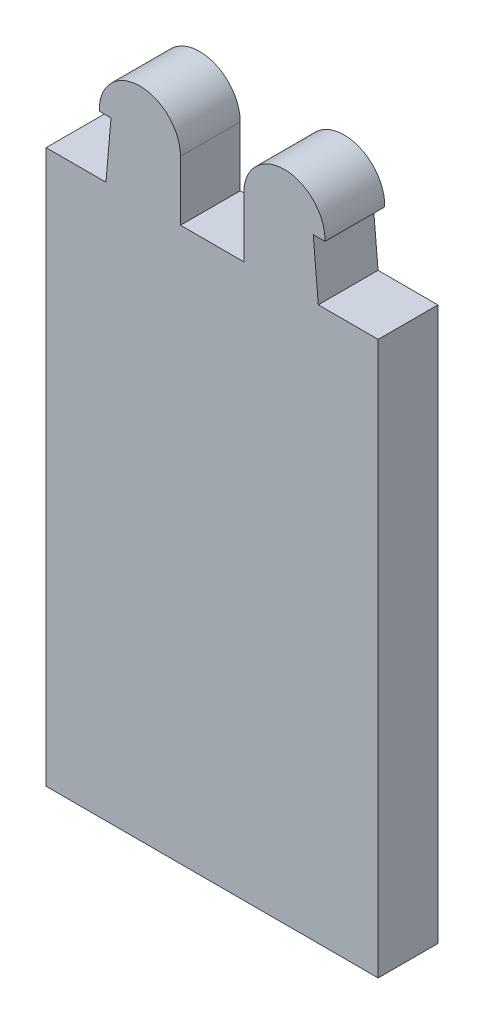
ISO-10303-21;
HEADER;
FILE_DESCRIPTION(('STEP AP214'),'2;1');
FILE_NAME('part.step','',(''),(''),'','','');
FILE_SCHEMA(('AUTOMOTIVE_DESIGN { 1 0 10303 214 1 1 1 1 }'));
ENDSEC;
DATA;
#1=APPLICATION_CONTEXT('core data for automotive mechanical design processes');
#2=APPLICATION_PROTOCOL_DEFINITION('international standard','automotive_design',2000,#1);
#3=PRODUCT_CONTEXT('',#1,'mechanical');
#4=PRODUCT('Part','Part','',(#3));
#5=PRODUCT_RELATED_PRODUCT_CATEGORY('part','',(#4));
#6=PRODUCT_DEFINITION_FORMATION('','',#4);
#7=PRODUCT_DEFINITION_CONTEXT('part definition',#1,'design');
#8=PRODUCT_DEFINITION('design','',#6,#7);
#9=PRODUCT_DEFINITION_SHAPE('','',#8);
#10=(LENGTH_UNIT() NAMED_UNIT(*) SI_UNIT(.MILLI.,.METRE.));
#11=(NAMED_UNIT(*) PLANE_ANGLE_UNIT() SI_UNIT($,.RADIAN.));
#12=(NAMED_UNIT(*) SI_UNIT($,.STERADIAN.) SOLID_ANGLE_UNIT());
#13=UNCERTAINTY_MEASURE_WITH_UNIT(LENGTH_MEASURE(1.E-05),#10,'distance_accuracy_value','');
#14=(GEOMETRIC_REPRESENTATION_CONTEXT(3) GLOBAL_UNCERTAINTY_ASSIGNED_CONTEXT((#13)) GLOBAL_UNIT_ASSIGNED_CONTEXT((#10,
#11,#12)) REPRESENTATION_CONTEXT('',''));
#15=CARTESIAN_POINT('',(0.,0.,0.));
#16=DIRECTION('',(0.,0.,1.));
#17=DIRECTION('',(1.,0.,0.));
#18=AXIS2_PLACEMENT_3D('',#15,#16,#17);
#19=CARTESIAN_POINT('',(-3.26487000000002,15.2,2.7));
#20=DIRECTION('',(0.,0.,-1.));
#21=DIRECTION('',(-1.,0.,0.));
#22=AXIS2_PLACEMENT_3D('',#19,#20,#21);
#23=CYLINDRICAL_SURFACE('',#22,1.83487);
#24=CARTESIAN_POINT('',(-3.26487000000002,15.2,0.));
#25=DIRECTION('',(0.,0.,1.));
#26=DIRECTION('',(1.,0.,0.));
#27=AXIS2_PLACEMENT_3D('',#24,#25,#26);
#28=CIRCLE('',#27,1.83487);
#29=CARTESIAN_POINT('',(-5.09840426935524,15.13,0.));
#30=VERTEX_POINT('',#29);
#31=CARTESIAN_POINT('',(-1.43000000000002,15.2,0.));
#32=VERTEX_POINT('',#31);
#33=EDGE_CURVE('E182',#30,#32,#28,.F.);
#34=ORIENTED_EDGE('',*,*,#33,.F.);
#35=DIRECTION('',(0.,0.,-1.));
#36=VECTOR('',#35,1.);
#37=CARTESIAN_POINT('',(-5.09840426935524,15.13,2.7));
#38=LINE('',#37,#36);
#39=CARTESIAN_POINT('',(-5.09840426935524,15.13,2.7));
#40=VERTEX_POINT('',#39);
#41=EDGE_CURVE('E11',#40,#30,#38,.T.);
#42=ORIENTED_EDGE('',*,*,#41,.F.);
#43=CARTESIAN_POINT('',(-3.26487000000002,15.2,2.7));
#44=DIRECTION('',(0.,0.,1.));
#45=DIRECTION('',(1.,0.,0.));
#46=AXIS2_PLACEMENT_3D('',#43,#44,#45);
#47=CIRCLE('',#46,1.83487);
#48=CARTESIAN_POINT('',(-1.43000000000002,15.2,2.7));
#49=VERTEX_POINT('',#48);
#50=EDGE_CURVE('E229',#40,#49,#47,.F.);
#51=ORIENTED_EDGE('',*,*,#50,.T.);
#52=DIRECTION('',(0.,0.,-1.));
#53=VECTOR('',#52,1.);
#54=CARTESIAN_POINT('',(-1.43000000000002,15.2,2.7));
#55=LINE('',#54,#53);
#56=EDGE_CURVE('E116',#49,#32,#55,.T.);
#57=ORIENTED_EDGE('',*,*,#56,.T.);
#58=EDGE_LOOP('',(#34,#42,#51,#57));
#59=FACE_BOUND('',#58,.T.);
#60=ADVANCED_FACE('F47',(#59),#23,.T.);
#61=CARTESIAN_POINT('',(0.,15.13,2.7));
#62=DIRECTION('',(0.,-1.,0.));
#63=DIRECTION('',(0.,0.,-1.));
#64=AXIS2_PLACEMENT_3D('',#61,#62,#63);
#65=PLANE('',#64);
#66=DIRECTION('',(-1.,0.,0.));
#67=VECTOR('',#66,1.);
#68=CARTESIAN_POINT('',(0.,15.13,0.));
#69=LINE('',#68,#67);
#70=CARTESIAN_POINT('',(-4.57000000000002,15.13,0.));
#71=VERTEX_POINT('',#70);
#72=EDGE_CURVE('E186',#71,#30,#69,.T.);
#73=ORIENTED_EDGE('',*,*,#72,.F.);
#74=DIRECTION('',(0.,0.,-1.));
#75=VECTOR('',#74,1.);
#76=CARTESIAN_POINT('',(-4.57000000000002,15.13,2.7));
#77=LINE('',#76,#75);
#78=CARTESIAN_POINT('',(-4.57000000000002,15.13,2.7));
#79=VERTEX_POINT('',#78);
#80=EDGE_CURVE('E56',#79,#71,#77,.T.);
#81=ORIENTED_EDGE('',*,*,#80,.F.);
#82=DIRECTION('',(-1.,0.,0.));
#83=VECTOR('',#82,1.);
#84=CARTESIAN_POINT('',(0.,15.13,2.7));
#85=LINE('',#84,#83);
#86=EDGE_CURVE('E289',#79,#40,#85,.T.);
#87=ORIENTED_EDGE('',*,*,#86,.T.);
#88=ORIENTED_EDGE('',*,*,#41,.T.);
#89=EDGE_LOOP('',(#73,#81,#87,#88));
#90=FACE_BOUND('',#89,.T.);
#91=ADVANCED_FACE('F274',(#90),#65,.T.);
#92=CARTESIAN_POINT('',(-5.84893417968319,0.51171543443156,2.7));
#93=DIRECTION('',(-0.996194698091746,0.0871557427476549,0.));
#94=DIRECTION('',(-0.0871557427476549,-0.996194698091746,0.));
#95=AXIS2_PLACEMENT_3D('',#92,#93,#94);
#96=PLANE('',#95);
#97=DIRECTION('',(0.0871557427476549,0.996194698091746,0.));
#98=VECTOR('',#97,1.);
#99=CARTESIAN_POINT('',(-5.84893417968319,0.51171543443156,0.));
#100=LINE('',#99,#98);
#101=CARTESIAN_POINT('',(-4.80009518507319,12.5,0.));
#102=VERTEX_POINT('',#101);
#103=EDGE_CURVE('E190',#102,#71,#100,.T.);
#104=ORIENTED_EDGE('',*,*,#103,.F.);
#105=DIRECTION('',(0.,0.,-1.));
#106=VECTOR('',#105,1.);
#107=CARTESIAN_POINT('',(-4.80009518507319,12.5,2.7));
#108=LINE('',#107,#106);
#109=CARTESIAN_POINT('',(-4.80009518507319,12.5,2.7));
#110=VERTEX_POINT('',#109);
#111=EDGE_CURVE('E261',#110,#102,#108,.T.);
#112=ORIENTED_EDGE('',*,*,#111,.F.);
#113=DIRECTION('',(0.0871557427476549,0.996194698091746,0.));
#114=VECTOR('',#113,1.);
#115=CARTESIAN_POINT('',(-5.84893417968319,0.51171543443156,2.7));
#116=LINE('',#115,#114);
#117=EDGE_CURVE('E270',#110,#79,#116,.T.);
#118=ORIENTED_EDGE('',*,*,#117,.T.);
#119=ORIENTED_EDGE('',*,*,#80,.T.);
#120=EDGE_LOOP('',(#104,#112,#118,#119));
#121=FACE_BOUND('',#120,.T.);
#122=ADVANCED_FACE('F268',(#121),#96,.T.);
#123=CARTESIAN_POINT('',(0.,12.5,2.7));
#124=DIRECTION('',(0.,-1.,0.));
#125=DIRECTION('',(1.,0.,0.));
#126=AXIS2_PLACEMENT_3D('',#123,#124,#125);
#127=PLANE('',#126);
#128=DIRECTION('',(-1.,0.,0.));
#129=VECTOR('',#128,1.);
#130=CARTESIAN_POINT('',(0.,12.5,0.));
#131=LINE('',#130,#129);
#132=CARTESIAN_POINT('',(-7.50526,12.5,0.));
#133=VERTEX_POINT('',#132);
#134=EDGE_CURVE('E194',#102,#133,#131,.T.);
#135=ORIENTED_EDGE('',*,*,#134,.T.);
#136=DIRECTION('',(0.,0.,-1.));
#137=VECTOR('',#136,1.);
#138=CARTESIAN_POINT('',(-7.50526,12.5,2.7));
#139=LINE('',#138,#137);
#140=CARTESIAN_POINT('',(-7.50526,12.5,2.7));
#141=VERTEX_POINT('',#140);
#142=EDGE_CURVE('E258',#141,#133,#139,.T.);
#143=ORIENTED_EDGE('',*,*,#142,.F.);
#144=DIRECTION('',(-1.,0.,0.));
#145=VECTOR('',#144,1.);
#146=CARTESIAN_POINT('',(0.,12.5,2.7));
#147=LINE('',#146,#145);
#148=EDGE_CURVE('E284',#110,#141,#147,.T.);
#149=ORIENTED_EDGE('',*,*,#148,.F.);
#150=ORIENTED_EDGE('',*,*,#111,.T.);
#151=EDGE_LOOP('',(#135,#143,#149,#150));
#152=FACE_BOUND('',#151,.T.);
#153=ADVANCED_FACE('F281',(#152),#127,.F.);
#154=CARTESIAN_POINT('',(-7.50526,0.,2.7));
#155=DIRECTION('',(-1.,0.,0.));
#156=DIRECTION('',(0.,0.,1.));
#157=AXIS2_PLACEMENT_3D('',#154,#155,#156);
#158=PLANE('',#157);
#159=DIRECTION('',(0.,1.,0.));
#160=VECTOR('',#159,1.);
#161=CARTESIAN_POINT('',(-7.50526,0.,0.));
#162=LINE('',#161,#160);
#163=CARTESIAN_POINT('',(-7.50526,-12.5,0.));
#164=VERTEX_POINT('',#163);
#165=EDGE_CURVE('E198',#164,#133,#162,.T.);
#166=ORIENTED_EDGE('',*,*,#165,.F.);
#167=DIRECTION('',(0.,0.,-1.));
#168=VECTOR('',#167,1.);
#169=CARTESIAN_POINT('',(-7.50526,-12.5,2.7));
#170=LINE('',#169,#168);
#171=CARTESIAN_POINT('',(-7.50526,-12.5,2.7));
#172=VERTEX_POINT('',#171);
#173=EDGE_CURVE('E255',#172,#164,#170,.T.);
#174=ORIENTED_EDGE('',*,*,#173,.F.);
#175=DIRECTION('',(0.,1.,0.));
#176=VECTOR('',#175,1.);
#177=CARTESIAN_POINT('',(-7.50526,0.,2.7));
#178=LINE('',#177,#176);
#179=EDGE_CURVE('E287',#172,#141,#178,.T.);
#180=ORIENTED_EDGE('',*,*,#179,.T.);
#181=ORIENTED_EDGE('',*,*,#142,.T.);
#182=EDGE_LOOP('',(#166,#174,#180,#181));
#183=FACE_BOUND('',#182,.T.);
#184=ADVANCED_FACE('F336',(#183),#158,.T.);
#185=CARTESIAN_POINT('',(0.,-12.5,2.7));
#186=DIRECTION('',(0.,-1.,0.));
#187=DIRECTION('',(1.,0.,0.));
#188=AXIS2_PLACEMENT_3D('',#185,#186,#187);
#189=PLANE('',#188);
#190=DIRECTION('',(-1.,0.,0.));
#191=VECTOR('',#190,1.);
#192=CARTESIAN_POINT('',(0.,-12.5,0.));
#193=LINE('',#192,#191);
#194=CARTESIAN_POINT('',(7.50526,-12.5,0.));
#195=VERTEX_POINT('',#194);
#196=EDGE_CURVE('E202',#195,#164,#193,.T.);
#197=ORIENTED_EDGE('',*,*,#196,.F.);
#198=DIRECTION('',(0.,0.,-1.));
#199=VECTOR('',#198,1.);
#200=CARTESIAN_POINT('',(7.50526,-12.5,2.7));
#201=LINE('',#200,#199);
#202=CARTESIAN_POINT('',(7.50526,-12.5,2.7));
#203=VERTEX_POINT('',#202);
#204=EDGE_CURVE('E252',#203,#195,#201,.T.);
#205=ORIENTED_EDGE('',*,*,#204,.F.);
#206=DIRECTION('',(-1.,0.,0.));
#207=VECTOR('',#206,1.);
#208=CARTESIAN_POINT('',(0.,-12.5,2.7));
#209=LINE('',#208,#207);
#210=EDGE_CURVE('E298',#203,#172,#209,.T.);
#211=ORIENTED_EDGE('',*,*,#210,.T.);
#212=ORIENTED_EDGE('',*,*,#173,.T.);
#213=EDGE_LOOP('',(#197,#205,#211,#212));
#214=FACE_BOUND('',#213,.T.);
#215=ADVANCED_FACE('F339',(#214),#189,.T.);
#216=CARTESIAN_POINT('',(7.50526,0.,2.7));
#217=DIRECTION('',(-1.,0.,0.));
#218=DIRECTION('',(0.,-1.,0.));
#219=AXIS2_PLACEMENT_3D('',#216,#217,#218);
#220=PLANE('',#219);
#221=DIRECTION('',(0.,1.,0.));
#222=VECTOR('',#221,1.);
#223=CARTESIAN_POINT('',(7.50526,0.,0.));
#224=LINE('',#223,#222);
#225=CARTESIAN_POINT('',(7.50526,12.5,0.));
#226=VERTEX_POINT('',#225);
#227=EDGE_CURVE('E206',#195,#226,#224,.T.);
#228=ORIENTED_EDGE('',*,*,#227,.T.);
#229=DIRECTION('',(0.,0.,-1.));
#230=VECTOR('',#229,1.);
#231=CARTESIAN_POINT('',(7.50526,12.5,2.7));
#232=LINE('',#231,#230);
#233=CARTESIAN_POINT('',(7.50526,12.5,2.7));
#234=VERTEX_POINT('',#233);
#235=EDGE_CURVE('E248',#234,#226,#232,.T.);
#236=ORIENTED_EDGE('',*,*,#235,.F.);
#237=DIRECTION('',(0.,1.,0.));
#238=VECTOR('',#237,1.);
#239=CARTESIAN_POINT('',(7.50526,0.,2.7));
#240=LINE('',#239,#238);
#241=EDGE_CURVE('E302',#203,#234,#240,.T.);
#242=ORIENTED_EDGE('',*,*,#241,.F.);
#243=ORIENTED_EDGE('',*,*,#204,.T.);
#244=EDGE_LOOP('',(#228,#236,#242,#243));
#245=FACE_BOUND('',#244,.T.);
#246=ADVANCED_FACE('F343',(#245),#220,.F.);
#247=CARTESIAN_POINT('',(0.,12.5,2.7));
#248=DIRECTION('',(0.,-1.,0.));
#249=DIRECTION('',(1.,0.,0.));
#250=AXIS2_PLACEMENT_3D('',#247,#248,#249);
#251=PLANE('',#250);
#252=DIRECTION('',(-1.,0.,0.));
#253=VECTOR('',#252,1.);
#254=CARTESIAN_POINT('',(0.,12.5,0.));
#255=LINE('',#254,#253);
#256=CARTESIAN_POINT('',(4.80009518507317,12.5,0.));
#257=VERTEX_POINT('',#256);
#258=EDGE_CURVE('E209',#226,#257,#255,.T.);
#259=ORIENTED_EDGE('',*,*,#258,.T.);
#260=DIRECTION('',(0.,0.,-1.));
#261=VECTOR('',#260,1.);
#262=CARTESIAN_POINT('',(4.80009518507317,12.5,2.7));
#263=LINE('',#262,#261);
#264=CARTESIAN_POINT('',(4.80009518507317,12.5,2.7));
#265=VERTEX_POINT('',#264);
#266=EDGE_CURVE('E244',#265,#257,#263,.T.);
#267=ORIENTED_EDGE('',*,*,#266,.F.);
#268=DIRECTION('',(-1.,0.,0.));
#269=VECTOR('',#268,1.);
#270=CARTESIAN_POINT('',(0.,12.5,2.7));
#271=LINE('',#270,#269);
#272=EDGE_CURVE('E305',#234,#265,#271,.T.);
#273=ORIENTED_EDGE('',*,*,#272,.F.);
#274=ORIENTED_EDGE('',*,*,#235,.T.);
#275=EDGE_LOOP('',(#259,#267,#273,#274));
#276=FACE_BOUND('',#275,.T.);
#277=ADVANCED_FACE('F347',(#276),#251,.F.);
#278=CARTESIAN_POINT('',(5.84893417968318,0.511715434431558,2.7));
#279=DIRECTION('',(-0.996194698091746,-0.0871557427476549,0.));
#280=DIRECTION('',(0.0871557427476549,-0.996194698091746,0.));
#281=AXIS2_PLACEMENT_3D('',#278,#279,#280);
#282=PLANE('',#281);
#283=DIRECTION('',(-0.0871557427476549,0.996194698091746,0.));
#284=VECTOR('',#283,1.);
#285=CARTESIAN_POINT('',(5.84893417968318,0.511715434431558,0.));
#286=LINE('',#285,#284);
#287=CARTESIAN_POINT('',(4.57,15.13,0.));
#288=VERTEX_POINT('',#287);
#289=EDGE_CURVE('E212',#257,#288,#286,.T.);
#290=ORIENTED_EDGE('',*,*,#289,.T.);
#291=DIRECTION('',(0.,0.,-1.));
#292=VECTOR('',#291,1.);
#293=CARTESIAN_POINT('',(4.57,15.13,2.7));
#294=LINE('',#293,#292);
#295=CARTESIAN_POINT('',(4.57,15.13,2.7));
#296=VERTEX_POINT('',#295);
#297=EDGE_CURVE('E240',#296,#288,#294,.T.);
#298=ORIENTED_EDGE('',*,*,#297,.F.);
#299=DIRECTION('',(-0.0871557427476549,0.996194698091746,0.));
#300=VECTOR('',#299,1.);
#301=CARTESIAN_POINT('',(5.84893417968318,0.511715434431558,2.7));
#302=LINE('',#301,#300);
#303=EDGE_CURVE('E308',#265,#296,#302,.T.);
#304=ORIENTED_EDGE('',*,*,#303,.F.);
#305=ORIENTED_EDGE('',*,*,#266,.T.);
#306=EDGE_LOOP('',(#290,#298,#304,#305));
#307=FACE_BOUND('',#306,.T.);
#308=ADVANCED_FACE('F351',(#307),#282,.F.);
#309=CARTESIAN_POINT('',(0.,15.13,2.7));
#310=DIRECTION('',(0.,1.,0.));
#311=DIRECTION('',(0.,0.,1.));
#312=AXIS2_PLACEMENT_3D('',#309,#310,#311);
#313=PLANE('',#312);
#314=DIRECTION('',(1.,0.,0.));
#315=VECTOR('',#314,1.);
#316=CARTESIAN_POINT('',(0.,15.13,0.));
#317=LINE('',#316,#315);
#318=CARTESIAN_POINT('',(5.09840426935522,15.13,0.));
#319=VERTEX_POINT('',#318);
#320=EDGE_CURVE('E215',#288,#319,#317,.T.);
#321=ORIENTED_EDGE('',*,*,#320,.T.);
#322=DIRECTION('',(0.,0.,-1.));
#323=VECTOR('',#322,1.);
#324=CARTESIAN_POINT('',(5.09840426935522,15.13,2.7));
#325=LINE('',#324,#323);
#326=CARTESIAN_POINT('',(5.09840426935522,15.13,2.7));
#327=VERTEX_POINT('',#326);
#328=EDGE_CURVE('E236',#327,#319,#325,.T.);
#329=ORIENTED_EDGE('',*,*,#328,.F.);
#330=DIRECTION('',(1.,0.,0.));
#331=VECTOR('',#330,1.);
#332=CARTESIAN_POINT('',(0.,15.13,2.7));
#333=LINE('',#332,#331);
#334=EDGE_CURVE('E176',#296,#327,#333,.T.);
#335=ORIENTED_EDGE('',*,*,#334,.F.);
#336=ORIENTED_EDGE('',*,*,#297,.T.);
#337=EDGE_LOOP('',(#321,#329,#335,#336));
#338=FACE_BOUND('',#337,.T.);
#339=ADVANCED_FACE('F316',(#338),#313,.F.);
#340=CARTESIAN_POINT('',(3.26487,15.2,2.7));
#341=DIRECTION('',(0.,0.,-1.));
#342=DIRECTION('',(-1.,0.,0.));
#343=AXIS2_PLACEMENT_3D('',#340,#341,#342);
#344=CYLINDRICAL_SURFACE('',#343,1.83487);
#345=CARTESIAN_POINT('',(3.26487,15.2,0.));
#346=DIRECTION('',(0.,0.,1.));
#347=DIRECTION('',(1.,0.,0.));
#348=AXIS2_PLACEMENT_3D('',#345,#346,#347);
#349=CIRCLE('',#348,1.83487);
#350=CARTESIAN_POINT('',(1.43,15.2,0.));
#351=VERTEX_POINT('',#350);
#352=EDGE_CURVE('E218',#319,#351,#349,.T.);
#353=ORIENTED_EDGE('',*,*,#352,.T.);
#354=DIRECTION('',(0.,0.,-1.));
#355=VECTOR('',#354,1.);
#356=CARTESIAN_POINT('',(1.43,15.2,2.7));
#357=LINE('',#356,#355);
#358=CARTESIAN_POINT('',(1.43,15.2,2.7));
#359=VERTEX_POINT('',#358);
#360=EDGE_CURVE('E162',#359,#351,#357,.T.);
#361=ORIENTED_EDGE('',*,*,#360,.F.);
#362=CARTESIAN_POINT('',(3.26487,15.2,2.7));
#363=DIRECTION('',(0.,0.,1.));
#364=DIRECTION('',(1.,0.,0.));
#365=AXIS2_PLACEMENT_3D('',#362,#363,#364);
#366=CIRCLE('',#365,1.83487);
#367=EDGE_CURVE('E171',#327,#359,#366,.T.);
#368=ORIENTED_EDGE('',*,*,#367,.F.);
#369=ORIENTED_EDGE('',*,*,#328,.T.);
#370=EDGE_LOOP('',(#353,#361,#368,#369));
#371=FACE_BOUND('',#370,.T.);
#372=ADVANCED_FACE('F320',(#371),#344,.T.);
#373=CARTESIAN_POINT('',(1.43,0.,2.7));
#374=DIRECTION('',(-1.,0.,0.));
#375=DIRECTION('',(0.,0.,1.));
#376=AXIS2_PLACEMENT_3D('',#373,#374,#375);
#377=PLANE('',#376);
#378=DIRECTION('',(0.,1.,0.));
#379=VECTOR('',#378,1.);
#380=CARTESIAN_POINT('',(1.43,0.,0.));
#381=LINE('',#380,#379);
#382=CARTESIAN_POINT('',(1.43,12.5,0.));
#383=VERTEX_POINT('',#382);
#384=EDGE_CURVE('E160',#383,#351,#381,.T.);
#385=ORIENTED_EDGE('',*,*,#384,.F.);
#386=DIRECTION('',(0.,0.,-1.));
#387=VECTOR('',#386,1.);
#388=CARTESIAN_POINT('',(1.43,12.5,2.7));
#389=LINE('',#388,#387);
#390=CARTESIAN_POINT('',(1.43,12.5,2.7));
#391=VERTEX_POINT('',#390);
#392=EDGE_CURVE('E154',#391,#383,#389,.T.);
#393=ORIENTED_EDGE('',*,*,#392,.F.);
#394=DIRECTION('',(0.,1.,0.));
#395=VECTOR('',#394,1.);
#396=CARTESIAN_POINT('',(1.43,0.,2.7));
#397=LINE('',#396,#395);
#398=EDGE_CURVE('E158',#391,#359,#397,.T.);
#399=ORIENTED_EDGE('',*,*,#398,.T.);
#400=ORIENTED_EDGE('',*,*,#360,.T.);
#401=EDGE_LOOP('',(#385,#393,#399,#400));
#402=FACE_BOUND('',#401,.T.);
#403=ADVANCED_FACE('F156',(#402),#377,.T.);
#404=CARTESIAN_POINT('',(0.,12.5,2.7));
#405=DIRECTION('',(0.,-1.,0.));
#406=DIRECTION('',(0.,0.,-1.));
#407=AXIS2_PLACEMENT_3D('',#404,#405,#406);
#408=PLANE('',#407);
#409=DIRECTION('',(-1.,0.,0.));
#410=VECTOR('',#409,1.);
#411=CARTESIAN_POINT('',(0.,12.5,0.));
#412=LINE('',#411,#410);
#413=CARTESIAN_POINT('',(-1.43000000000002,12.5,0.));
#414=VERTEX_POINT('',#413);
#415=EDGE_CURVE('E109',#383,#414,#412,.T.);
#416=ORIENTED_EDGE('',*,*,#415,.T.);
#417=DIRECTION('',(0.,0.,-1.));
#418=VECTOR('',#417,1.);
#419=CARTESIAN_POINT('',(-1.43000000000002,12.5,2.7));
#420=LINE('',#419,#418);
#421=CARTESIAN_POINT('',(-1.43000000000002,12.5,2.7));
#422=VERTEX_POINT('',#421);
#423=EDGE_CURVE('E163',#422,#414,#420,.T.);
#424=ORIENTED_EDGE('',*,*,#423,.F.);
#425=DIRECTION('',(-1.,0.,0.));
#426=VECTOR('',#425,1.);
#427=CARTESIAN_POINT('',(0.,12.5,2.7));
#428=LINE('',#427,#426);
#429=EDGE_CURVE('E165',#391,#422,#428,.T.);
#430=ORIENTED_EDGE('',*,*,#429,.F.);
#431=ORIENTED_EDGE('',*,*,#392,.T.);
#432=EDGE_LOOP('',(#416,#424,#430,#431));
#433=FACE_BOUND('',#432,.T.);
#434=ADVANCED_FACE('F166',(#433),#408,.F.);
#435=CARTESIAN_POINT('',(-1.43000000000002,0.,2.7));
#436=DIRECTION('',(-1.,0.,0.));
#437=DIRECTION('',(0.,0.,1.));
#438=AXIS2_PLACEMENT_3D('',#435,#436,#437);
#439=PLANE('',#438);
#440=DIRECTION('',(0.,1.,0.));
#441=VECTOR('',#440,1.);
#442=CARTESIAN_POINT('',(-1.43000000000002,0.,0.));
#443=LINE('',#442,#441);
#444=EDGE_CURVE('E226',#414,#32,#443,.T.);
#445=ORIENTED_EDGE('',*,*,#444,.T.);
#446=ORIENTED_EDGE('',*,*,#56,.F.);
#447=DIRECTION('',(0.,1.,0.));
#448=VECTOR('',#447,1.);
#449=CARTESIAN_POINT('',(-1.43000000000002,0.,2.7));
#450=LINE('',#449,#448);
#451=EDGE_CURVE('E64',#422,#49,#450,.T.);
#452=ORIENTED_EDGE('',*,*,#451,.F.);
#453=ORIENTED_EDGE('',*,*,#423,.T.);
#454=EDGE_LOOP('',(#445,#446,#452,#453));
#455=FACE_BOUND('',#454,.T.);
#456=ADVANCED_FACE('F323',(#455),#439,.F.);
#457=CARTESIAN_POINT('',(0.,0.,2.7));
#458=DIRECTION('',(0.,0.,1.));
#459=DIRECTION('',(1.,0.,0.));
#460=AXIS2_PLACEMENT_3D('',#457,#458,#459);
#461=PLANE('',#460);
#462=ORIENTED_EDGE('',*,*,#50,.F.);
#463=ORIENTED_EDGE('',*,*,#86,.F.);
#464=ORIENTED_EDGE('',*,*,#117,.F.);
#465=ORIENTED_EDGE('',*,*,#148,.T.);
#466=ORIENTED_EDGE('',*,*,#179,.F.);
#467=ORIENTED_EDGE('',*,*,#210,.F.);
#468=ORIENTED_EDGE('',*,*,#241,.T.);
#469=ORIENTED_EDGE('',*,*,#272,.T.);
#470=ORIENTED_EDGE('',*,*,#303,.T.);
#471=ORIENTED_EDGE('',*,*,#334,.T.);
#472=ORIENTED_EDGE('',*,*,#367,.T.);
#473=ORIENTED_EDGE('',*,*,#398,.F.);
#474=ORIENTED_EDGE('',*,*,#429,.T.);
#475=ORIENTED_EDGE('',*,*,#451,.T.);
#476=EDGE_LOOP('',(#462,#463,#464,#465,#466,#467,#468,#469,#470,#471,#472,#473,#474,#475));
#477=FACE_BOUND('',#476,.T.);
#478=ADVANCED_FACE('F169',(#477),#461,.T.);
#479=CARTESIAN_POINT('',(0.,0.,0.));
#480=DIRECTION('',(0.,0.,1.));
#481=DIRECTION('',(1.,0.,0.));
#482=AXIS2_PLACEMENT_3D('',#479,#480,#481);
#483=PLANE('',#482);
#484=ORIENTED_EDGE('',*,*,#33,.T.);
#485=ORIENTED_EDGE('',*,*,#444,.F.);
#486=ORIENTED_EDGE('',*,*,#415,.F.);
#487=ORIENTED_EDGE('',*,*,#384,.T.);
#488=ORIENTED_EDGE('',*,*,#352,.F.);
#489=ORIENTED_EDGE('',*,*,#320,.F.);
#490=ORIENTED_EDGE('',*,*,#289,.F.);
#491=ORIENTED_EDGE('',*,*,#258,.F.);
#492=ORIENTED_EDGE('',*,*,#227,.F.);
#493=ORIENTED_EDGE('',*,*,#196,.T.);
#494=ORIENTED_EDGE('',*,*,#165,.T.);
#495=ORIENTED_EDGE('',*,*,#134,.F.);
#496=ORIENTED_EDGE('',*,*,#103,.T.);
#497=ORIENTED_EDGE('',*,*,#72,.T.);
#498=EDGE_LOOP('',(#484,#485,#486,#487,#488,#489,#490,#491,#492,#493,#494,#495,#496,#497));
#499=FACE_BOUND('',#498,.T.);
#500=ADVANCED_FACE('F277',(#499),#483,.F.);
#501=CLOSED_SHELL('',(#60,#91,#122,#153,#184,#215,#246,#277,#308,#339,#372,#403,#434,#456,#478,#500));
#502=MANIFOLD_SOLID_BREP('B2',#501);
#503=ADVANCED_BREP_SHAPE_REPRESENTATION('',(#18,#502),#14);
#504=SHAPE_DEFINITION_REPRESENTATION(#9,#503);
ENDSEC;
END-ISO-10303-21;
